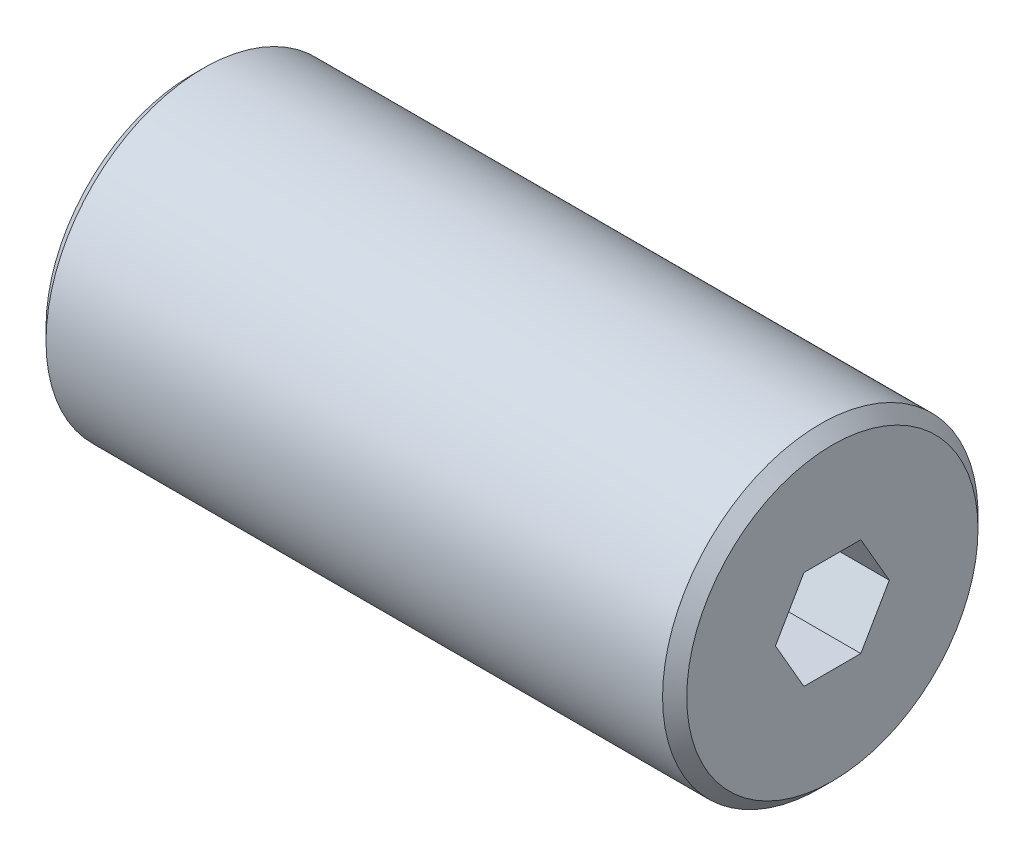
from build123d import *

# Parameters (mm, degrees)
LINEAR_AUSTRAGEN1_DEPTH = 4


with BuildPart() as part:
    # Skizze1 → Rotation1 (revolve)
    with BuildSketch(Plane.XY, mode=Mode.PRIVATE) as rotation1_sk:
        Polygon((8.5, 0), (8.5, 4.8), (0, 4.8), (0, 7.3865), (0.6135, 8), (31.8865, 8), (32.5, 7.3865), (32.5, 0), align=None)
    revolve(rotation1_sk.sketch.rotate(Axis((32.5, 0, 0), (-1, 0, 0)), 270), axis=Axis((32.5, 0, 0), (-1, 0, 0)))

    # Skizze2 → Linear austragen1 (cut)
    with BuildSketch(Plane(origin=(32.5, 0, 0), x_dir=(0, 0, -1), z_dir=(1, 0, 0))):
        Polygon((-2.886751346, 0), (-1.443375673, -2.5), (1.443375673, -2.5), (2.886751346, 0), (1.443375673, 2.5), (-1.443375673, 2.5), align=None)
    extrude(amount=-LINEAR_AUSTRAGEN1_DEPTH, mode=Mode.SUBTRACT)

    # Skizze3 → Schnitt-Rotation1 (revolve, cut)
    with BuildSketch(Plane.XY, mode=Mode.PRIVATE) as schnitt_rotation1_sk:
        Polygon((27.056624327, 0), (28.5, 2.5), (28.5, 0), align=None)
    revolve(schnitt_rotation1_sk.sketch.rotate(Axis((28.5, 0, 0), (-1, 0, 0)), 90), axis=Axis((28.5, 0, 0), (-1, 0, 0)), mode=Mode.SUBTRACT)


solid = part.part
